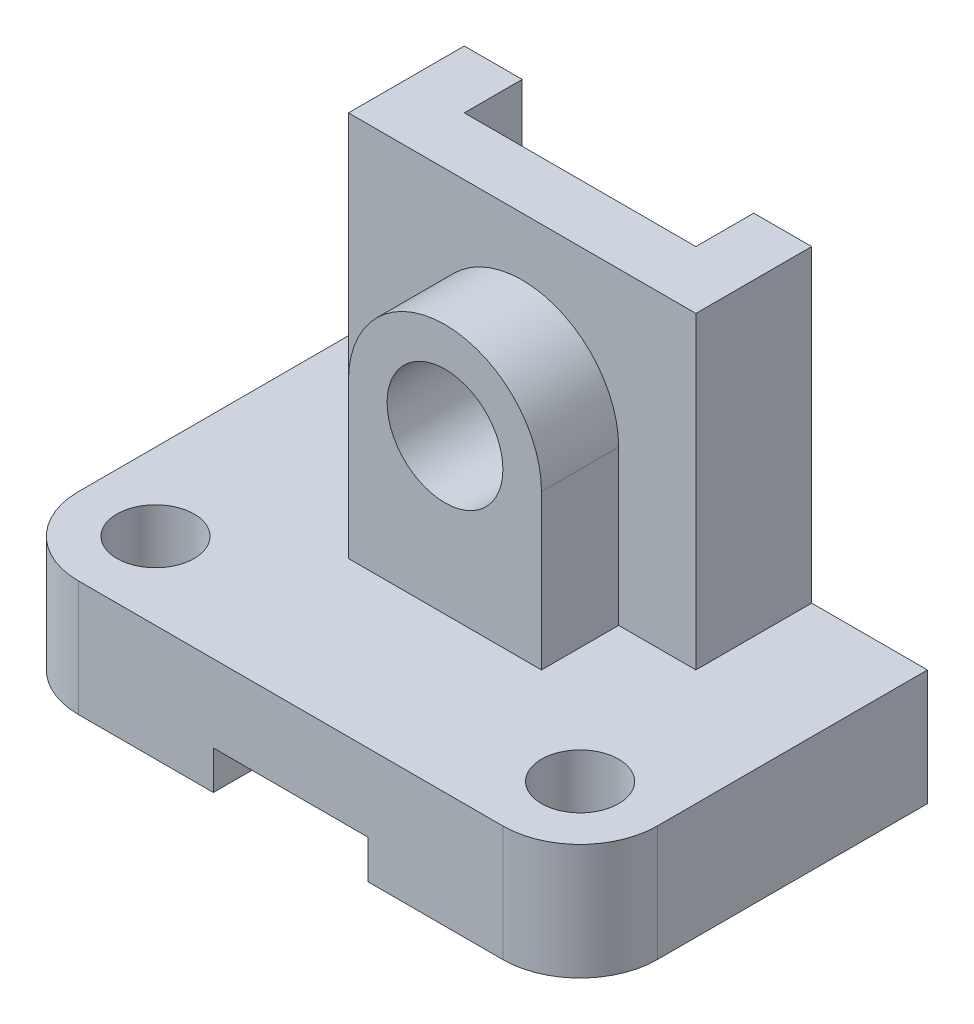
from build123d import *

# Parameters (mm, degrees)
SKETCH_1_R          = 2
EXTRUDE_1_DEPTH     = 6
EXTRUDE_2_DEPTH     = 16
EXTRUDE_3_DEPTH     = 4
SKETCH_5_R          = 3
CUT_EXTRUDE_1_DEPTH = 24
SKETCH_6_W          = 8
SKETCH_6_H          = 2
CUT_EXTRUDE_2_DEPTH = 24


with BuildPart() as part:
    # Sketch 1 → Extrude 1 (new body)
    with BuildSketch(Plane(origin=(0, 0, 0), x_dir=(1, 0, 0), z_dir=(0, 1, 0))):
        with BuildLine():
            Line((-15, -7.119835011), (-6, -7.119835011))
            Line((-6, -7.119835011), (-6, -10.119835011))
            Line((-6, -10.119835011), (6, -10.119835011))
            Line((6, -10.119835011), (6, -7.119835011))
            Line((6, -7.119835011), (15, -7.119835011))
            Line((15, -7.119835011), (15, -21.119835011))
            ThreePointArc((15, -21.119835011), (13.828427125, -23.948262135), (11, -25.119835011))
            Line((11, -25.119835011), (-11, -25.119835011))
            ThreePointArc((-11, -25.119835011), (-13.828427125, -23.948262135), (-15, -21.119835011))
            Line((-15, -21.119835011), (-15, -7.119835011))
        make_face()
        with Locations(Location((-11, -21.119835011, 0), (0, 0, 270))):
            Circle(SKETCH_1_R, mode=Mode.SUBTRACT)
        with Locations(Location((11, -21.119835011, 0), (0, 0, 270))):
            Circle(SKETCH_1_R, mode=Mode.SUBTRACT)
    extrude(amount=-EXTRUDE_1_DEPTH)

    # Sketch 2 → Extrude 2 (add)
    with BuildSketch(Plane(origin=(0, 0, 0), x_dir=(1, 0, 0), z_dir=(0, 1, 0))):
        Polygon((6, -10.119835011), (-6, -10.119835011), (-6, -7.119835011), (-9, -7.119835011), (-9, -13.119835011), (9, -13.119835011), (9, -7.119835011), (6, -7.119835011), align=None)
    extrude(amount=EXTRUDE_2_DEPTH)

    # Sketch 4 → Extrude 3 (add)
    with BuildSketch(Plane.XY.offset(13.119835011)):
        with BuildLine():
            Line((-5, 8), (-5, 0))
            Line((-5, 0), (0, 0))
            Line((0, 0), (5, 0))
            Line((5, 0), (5, 8))
            ThreePointArc((5, 8), (0, 13), (-5, 8))
        make_face()
    extrude(amount=EXTRUDE_3_DEPTH)

    # Sketch 5 → Cut-Extrude 1 (cut)
    with BuildSketch(Plane.XY):
        with Locations(Location((0, 8, 0), (0, 0, 180))):
            Circle(SKETCH_5_R)
    extrude(amount=CUT_EXTRUDE_1_DEPTH, mode=Mode.SUBTRACT)

    # Sketch 6 → Cut-Extrude 2 (cut)
    with BuildSketch(Plane.XY.offset(25.119835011)):
        with Locations((0, -5)):
            Rectangle(SKETCH_6_W, SKETCH_6_H)
    extrude(amount=-CUT_EXTRUDE_2_DEPTH, mode=Mode.SUBTRACT)


solid = part.part
